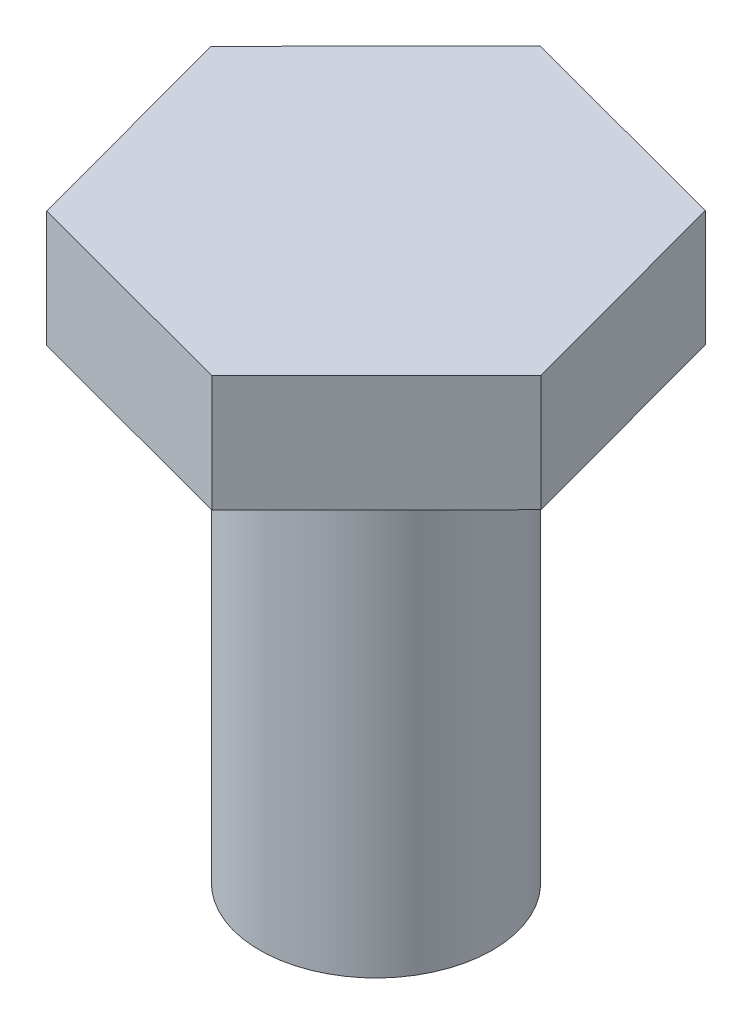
from build123d import *

# Parameters (mm, degrees)
SKETCH2_OUTSIDE_W  = 141.954
SKETCH2_OUTSIDE_H  = 141.954
CUT_EXTRUDE2_DEPTH = 146.911891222


with BuildPart() as part:
    # Sketch1 → Revolve1 (revolve)
    with BuildSketch(Plane.XY, mode=Mode.PRIVATE) as revolve1_sk:
        Polygon((0, -49.69004065), (25.4, -49.69004065), (25.4, 51.90995935), (50.8, 51.90995935), (50.8, 77.30995935), (0, 77.30995935), align=None)
    revolve(revolve1_sk.sketch.rotate(Axis((0, 101.367682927, 0), (0, -1, 0)), 180), axis=Axis((0, 101.367682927, 0), (0, -1, 0)))

    # Sketch2 outside → Cut-Extrude2 (cut, through all)
    with BuildSketch(Plane(origin=(0, 77.30995935, 0), x_dir=(-1, 0, 0), z_dir=(0, 1, 0))):
        Rectangle(SKETCH2_OUTSIDE_W, SKETCH2_OUTSIDE_H)
        Polygon((35.860804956, 35.981143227), (-13.230181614, 49.046939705), (-49.09098657, 13.065796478), (-35.860804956, -35.981143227), (13.230181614, -49.046939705), (49.09098657, -13.065796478), align=None, mode=Mode.SUBTRACT)
    extrude(amount=-CUT_EXTRUDE2_DEPTH, mode=Mode.SUBTRACT)


solid = part.part
